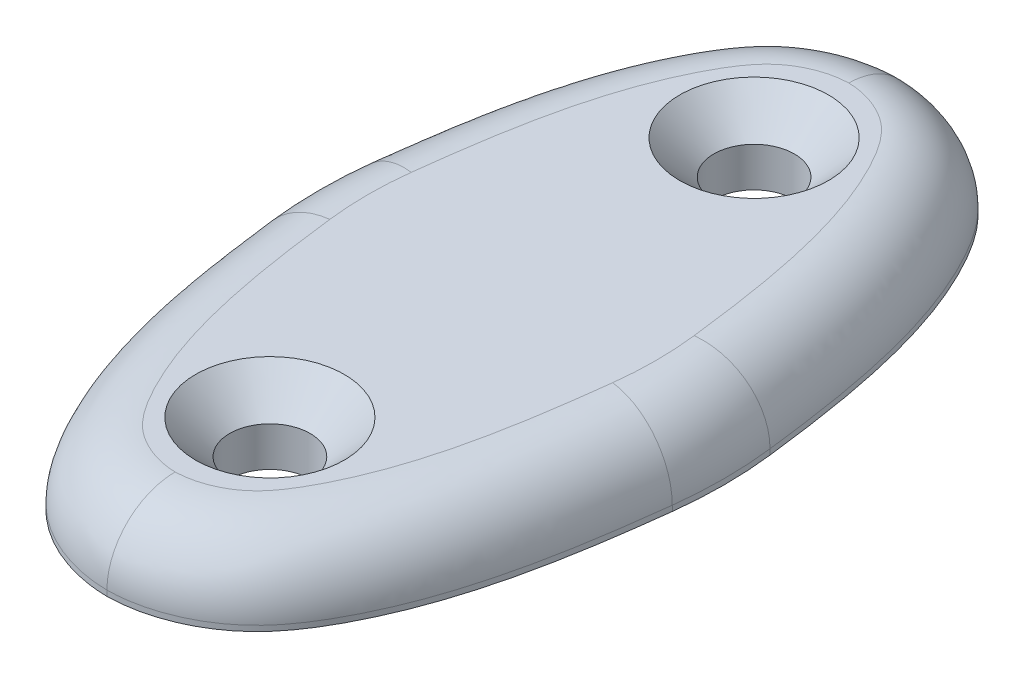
from build123d import *

# Parameters (mm, degrees)
BOSS_EXTRUDE1_DEPTH     = 5.4
FILLET1_R               = 30
CUT_EXTRUDE1_DEPTH      = 99.490139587
CUT_EXTRUDE1_DEPTH_BACK = 99.490139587
SKETCH2_R               = 2.95
FILLET2_R               = 5
CHAMFER1_SIZE           = 2.5


with BuildPart() as part:
    # Sketch1 → Boss-Extrude1 (new body)
    with BuildSketch(Plane(origin=(0, 0, 0), x_dir=(1, 0, 0), z_dir=(0, 1, 0))):
        with BuildLine():
            add(Edge.make_bspline(
                [(29.593373, 87.368633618), (26.891689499, 87.33924963), (22.370333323, 85.532032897), (18.001597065, 78.731983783), (15.166920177, 69.609196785), (14.329415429, 61.912978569), (13.843373, 57.668633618)],
                knots=[0, 0, 0, 0, 0.222632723, 0.366287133, 0.649159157, 1, 1, 1, 1], degree=3))
            add(Edge.make_bspline(
                [(29.593373, 27.968633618), (26.891689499, 27.998017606), (22.370333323, 29.805234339), (18.001597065, 36.605283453), (15.166920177, 45.728070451), (14.329415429, 53.424288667), (13.843373, 57.668633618)],
                knots=[0, 0, 0, 0, 0.222632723, 0.366287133, 0.649159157, 1, 1, 1, 1], degree=3))
            add(Edge.make_bspline(
                [(29.593373, 27.968633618), (32.295056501, 27.998017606), (36.816412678, 29.805234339), (41.185148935, 36.605283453), (44.019825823, 45.728070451), (44.857330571, 53.424288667), (45.343373, 57.668633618)],
                knots=[0, 0, 0, 0, 0.222632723, 0.366287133, 0.649159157, 1, 1, 1, 1], degree=3))
            add(Edge.make_bspline(
                [(29.593373, 87.368633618), (32.295056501, 87.33924963), (36.816412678, 85.532032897), (41.185148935, 78.731983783), (44.019825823, 69.609196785), (44.857330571, 61.912978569), (45.343373, 57.668633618)],
                knots=[0, 0, 0, 0, 0.222632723, 0.366287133, 0.649159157, 1, 1, 1, 1], degree=3))
        make_face()
    extrude(amount=BOSS_EXTRUDE1_DEPTH)

    # Fillet1
    fillet1_edges = [part.edges().sort_by_distance(p)[0] for p in [
        (13.843373, 2.7, -57.668633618),
        (45.343373, 2.7, -57.668633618),
    ]]
    fillet(fillet1_edges, radius=FILLET1_R)

    # Sketch2 → Cut-Extrude1 (cut, two sides: drawn at the far end of the back side and taken through both)
    with BuildSketch(Plane(origin=(0, 5.4, 0), x_dir=(1, 0, 0), z_dir=(0, 1, 0)).offset(-CUT_EXTRUDE1_DEPTH_BACK)):
        with Locations(Location((29.593373, 75.418633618, 0), (0, 0, 270))):
            Circle(SKETCH2_R)
        with Locations(Location((29.593373, 39.918633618, 0), (0, 0, 270))):
            Circle(SKETCH2_R)
    extrude(amount=CUT_EXTRUDE1_DEPTH + CUT_EXTRUDE1_DEPTH_BACK, mode=Mode.SUBTRACT)

    # Fillet2
    fillet2_edges = [part.edges().sort_by_distance(p)[0] for p in [
        (45.142767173, 5.4, -57.668633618),
        (14.043978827, 5.4, -57.668633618),
    ]]
    fillet(fillet2_edges, radius=FILLET2_R)

    # Chamfer1
    chamfer1_edges = [part.edges().sort_by_distance(p)[0] for p in [
        (29.593373, 5.4, -78.368633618),
        (29.593373, 5.4, -42.868633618),
    ]]
    chamfer(chamfer1_edges, length=CHAMFER1_SIZE)


solid = part.part
